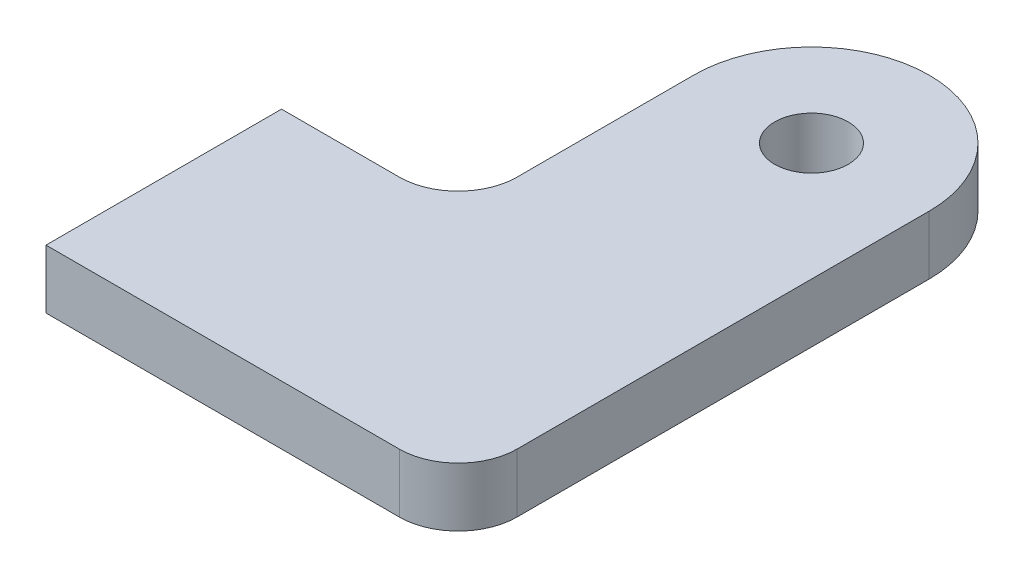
from build123d import *

# Parameters (mm, degrees)
SKETCH1_R      = 3.96875
EXTRUDE1_DEPTH = 6.35


with BuildPart() as part:
    # Sketch1 → Extrude1 (new body)
    with BuildSketch(Plane(origin=(0, 0, 0), x_dir=(1, 0, 0), z_dir=(0, 1, 0))):
        with BuildLine():
            Line((0, 25.4), (12.7, 25.4))
            ThreePointArc((12.7, 25.4), (17.190128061, 27.259871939), (19.05, 31.75))
            Line((19.05, 31.75), (19.05, 50.8))
            ThreePointArc((19.05, 50.8), (31.75, 63.5), (44.45, 50.8))
            Line((44.45, 50.8), (44.45, 6.35))
            ThreePointArc((44.45, 6.35), (42.590128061, 1.859871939), (38.1, 0))
            Line((38.1, 0), (0, 0))
            Line((0, 0), (0, 25.4))
        make_face()
        with Locations(Location((31.75, 50.8, 0), (0, 0, 270))):
            Circle(SKETCH1_R, mode=Mode.SUBTRACT)
    extrude(amount=EXTRUDE1_DEPTH)


solid = part.part
